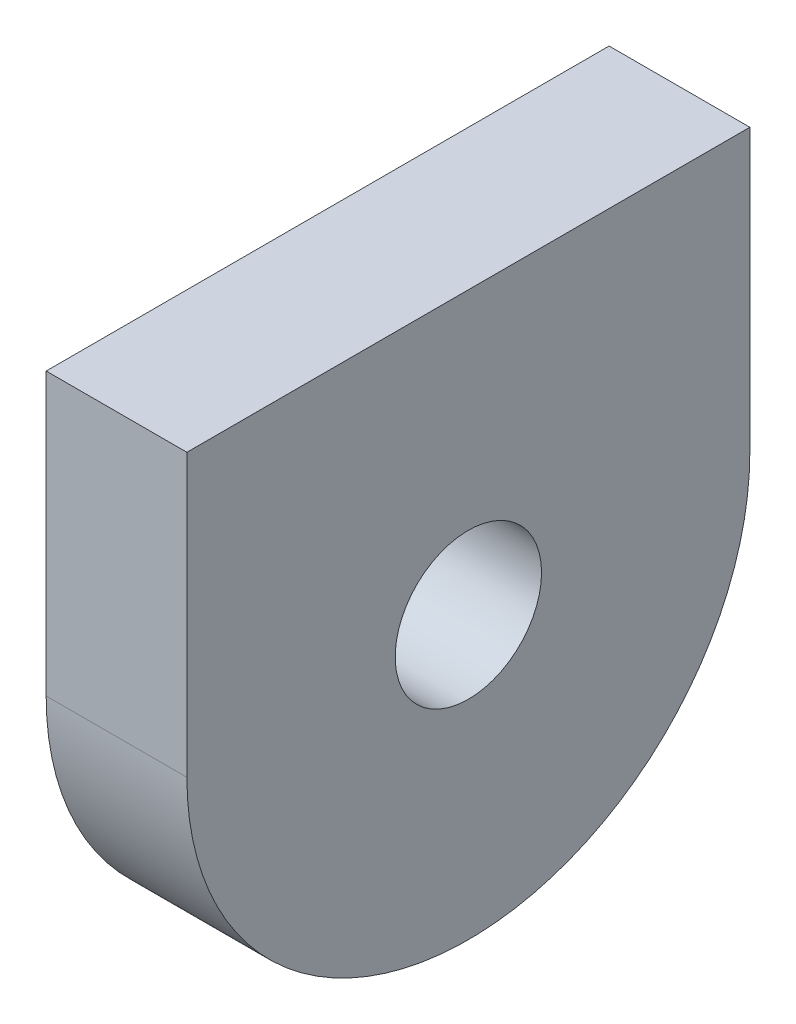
from build123d import *

# Parameters (mm, degrees)
BOSS_EXTRUDE1_DEPTH      = 3.175
BOSS_EXTRUDE1_DEPTH_BACK = 3.175
SKETCH1_R                = 3.302


with BuildPart() as part:
    # Sketch1 → Boss-Extrude1 (new, two sides: drawn at the far end of the back side and taken through both)
    with BuildSketch(Plane(origin=(0, 0, 0), x_dir=(0, 0, -1), z_dir=(1, 0, 0)).offset(-BOSS_EXTRUDE1_DEPTH_BACK)):
        with BuildLine():
            Line((-12.7, 0), (12.7, 0))
            Line((12.7, 0), (12.7, -12.7))
            ThreePointArc((12.7, -12.7), (0, -25.4), (-12.7, -12.7))
            Line((-12.7, -12.7), (-12.7, 0))
        make_face()
        with Locations((0, -12.7)):
            Circle(SKETCH1_R, mode=Mode.SUBTRACT)
    extrude(amount=BOSS_EXTRUDE1_DEPTH + BOSS_EXTRUDE1_DEPTH_BACK)


solid = part.part
